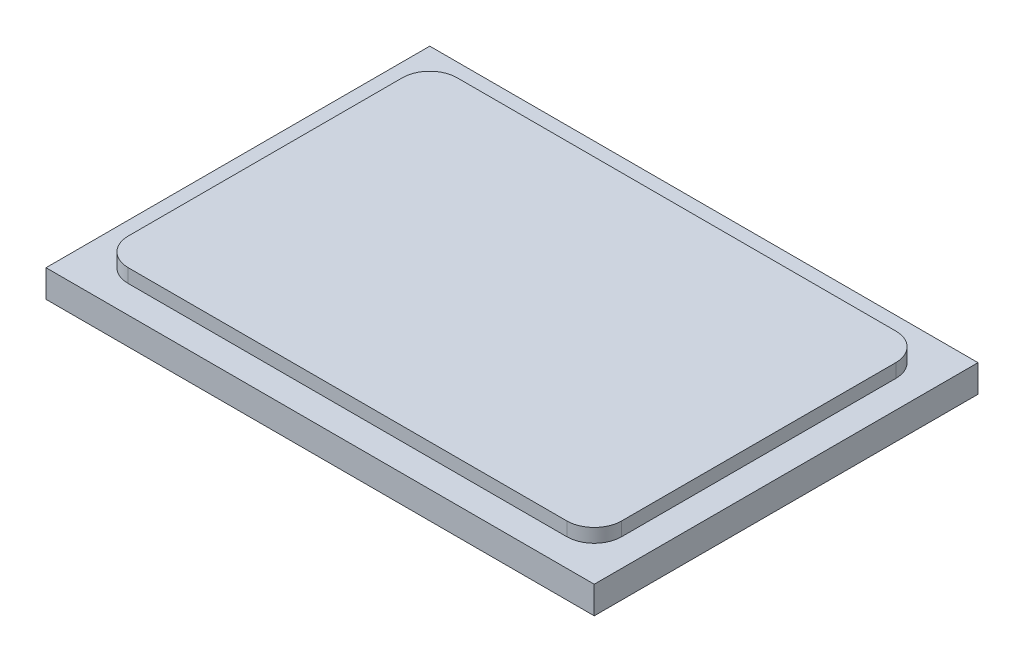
from build123d import *

# Parameters (mm, degrees)
SKETCH1_W           = 127
SKETCH1_H           = 88.9
BOSS_EXTRUDE1_DEPTH = 6.35
SKETCH2_W           = 114.3
SKETCH2_H           = 76.2
BOSS_EXTRUDE2_DEPTH = 3.175
CUT_EXTRUDE1_DEPTH  = 3.175


with BuildPart() as part:
    # Sketch1 → Boss-Extrude1 (new body)
    with BuildSketch(Plane(origin=(0, 0, 0), x_dir=(1, 0, 0), z_dir=(0, 1, 0))):
        with Locations((22.181728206, -19.194786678)):
            Rectangle(SKETCH1_W, SKETCH1_H)
    extrude(amount=BOSS_EXTRUDE1_DEPTH)

    # Sketch2 → Boss-Extrude2 (add)
    with BuildSketch(Plane(origin=(0, 6.35, 0), x_dir=(1, 0, 0), z_dir=(0, 1, 0))):
        with Locations((22.181728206, -19.194786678)):
            Rectangle(SKETCH2_W, SKETCH2_H)
    extrude(amount=BOSS_EXTRUDE2_DEPTH)

    # Sketch3 → Cut-Extrude1 (cut)
    with BuildSketch(Plane(origin=(0, 9.525, 0), x_dir=(1, 0, 0), z_dir=(0, 1, 0))):
        with BuildLine():
            Line((79.331728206, 18.905213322), (72.981728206, 18.905213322))
            ThreePointArc((72.981728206, 18.905213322), (77.471856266, 17.045341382), (79.331728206, 12.555213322))
            Line((79.331728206, 12.555213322), (79.331728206, 18.905213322))
        make_face()
        with BuildLine():
            ThreePointArc((79.331728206, -50.944786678), (77.471856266, -55.434914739), (72.981728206, -57.294786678))
            Line((72.981728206, -57.294786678), (79.331728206, -57.294786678))
            Line((79.331728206, -57.294786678), (79.331728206, -50.944786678))
        make_face()
        with BuildLine():
            ThreePointArc((-28.618271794, -57.294786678), (-33.108399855, -55.434914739), (-34.968271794, -50.944786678))
            Line((-34.968271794, -50.944786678), (-34.968271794, -57.294786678))
            Line((-34.968271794, -57.294786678), (-28.618271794, -57.294786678))
        make_face()
        with BuildLine():
            Line((-34.968271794, 18.905213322), (-34.968271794, 12.555213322))
            ThreePointArc((-34.968271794, 12.555213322), (-33.108399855, 17.045341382), (-28.618271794, 18.905213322))
            Line((-28.618271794, 18.905213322), (-34.968271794, 18.905213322))
        make_face()
    extrude(amount=-CUT_EXTRUDE1_DEPTH, mode=Mode.SUBTRACT)


solid = part.part
